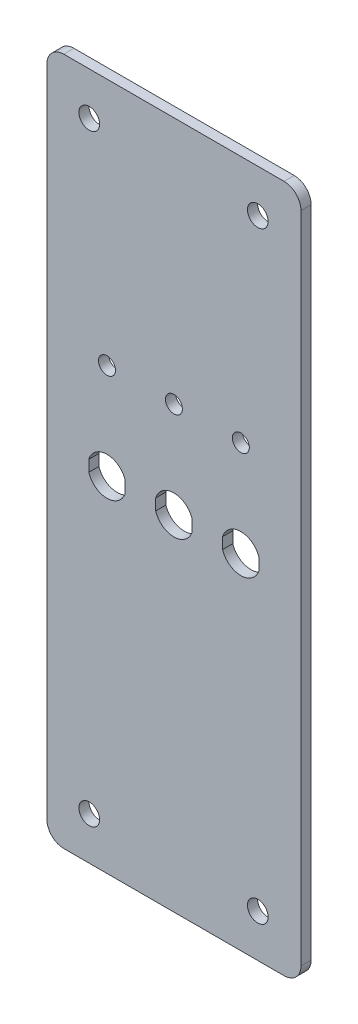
from build123d import *

# Parameters (mm, degrees)
SKETCH1_W           = 76.2
SKETCH1_H           = 206.2988
BOSS_EXTRUDE1_DEPTH = 3.048
SKETCH3_R           = 3.0988
SKETCH3_W           = 0.58311541
SKETCH3_H           = 2.856691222
CUT_EXTRUDE1_DEPTH  = 111.003177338
CUT_EXTRUDE2_DEPTH  = 111.003177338
FILLET1_R           = 5.08
SKETCH5_R           = 2.54
CUT_EXTRUDE3_DEPTH  = 3.0988


with BuildPart() as part:
    # Sketch1 → Boss-Extrude1 (new body)
    with BuildSketch(Plane.XY):
        Rectangle(SKETCH1_W, SKETCH1_H)
    extrude(amount=BOSS_EXTRUDE1_DEPTH)

    # Sketch3 → Cut-Extrude1 (cut, through all)
    with BuildSketch(Plane.XY.offset(3.048)):
        with Locations((-25.4, 90.3097)):
            Circle(SKETCH3_R)
        with Locations((25.146, 90.3097)):
            Circle(SKETCH3_R)
        with Locations((25.146, -90.3097)):
            Circle(SKETCH3_R)
        with Locations((-25.4, -90.3097)):
            Circle(SKETCH3_R)
        with Locations((38.220016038, 111.792786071)):
            Rectangle(SKETCH3_W, SKETCH3_H)
    extrude(amount=-CUT_EXTRUDE1_DEPTH, mode=Mode.SUBTRACT)

    # Sketch4 → Cut-Extrude2 (cut, through all)
    with BuildSketch(Plane.XY.offset(3.048)):
        with BuildLine():
            Line((-5.461, 1.684845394), (-5.461, -1.684845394))
            ThreePointArc((-5.461, -1.684845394), (0, -5.715), (5.461, -1.684845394))
            Line((5.461, -1.684845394), (5.461, 1.684845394))
            ThreePointArc((5.461, 1.684845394), (0, 5.715), (-5.461, 1.684845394))
        make_face()
        with BuildLine():
            Line((25.527, 1.684845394), (25.527, -1.684845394))
            ThreePointArc((25.527, -1.684845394), (20.066, -5.715), (14.605, -1.684845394))
            Line((14.605, -1.684845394), (14.605, 1.684845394))
            ThreePointArc((14.605, 1.684845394), (20.066, 5.715), (25.527, 1.684845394))
        make_face()
        with BuildLine():
            Line((-14.605, 1.684845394), (-14.605, -1.684845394))
            ThreePointArc((-14.605, -1.684845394), (-20.066, -5.715), (-25.527, -1.684845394))
            Line((-25.527, -1.684845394), (-25.527, 1.684845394))
            ThreePointArc((-25.527, 1.684845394), (-20.066, 5.715), (-14.605, 1.684845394))
        make_face()
    extrude(amount=-CUT_EXTRUDE2_DEPTH, mode=Mode.SUBTRACT)

    # Fillet1
    fillet1_edges = [part.edges().sort_by_distance(p)[0] for p in [
        (38.1, -103.1494, 1.524),
        (-38.1, -103.1494, 1.524),
        (-38.1, 103.1494, 1.524),
        (38.1, 103.1494, 1.524),
    ]]
    fillet(fillet1_edges, radius=FILLET1_R)

    # Sketch5 → Cut-Extrude3 (cut)
    with BuildSketch(Plane.XY.offset(3.048)):
        with Locations((0, 28.7782)):
            Circle(SKETCH5_R)
        with Locations(Location((-20.066, 28.7782, 0), (0, 0, 180))):
            Circle(SKETCH5_R)
        with Locations(Location((20.066, 28.7782, 0), (0, 0, 180))):
            Circle(SKETCH5_R)
    extrude(amount=-CUT_EXTRUDE3_DEPTH, mode=Mode.SUBTRACT)


solid = part.part
